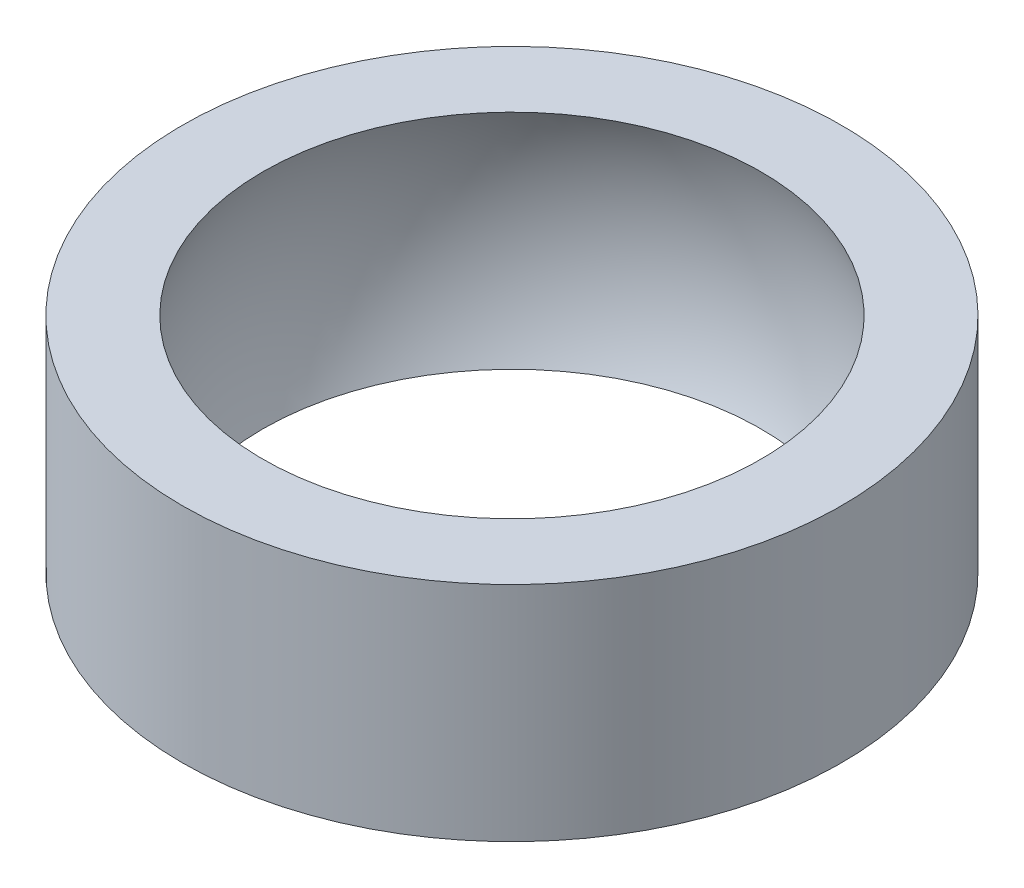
from build123d import *


with BuildPart() as part:
    # Esquisse1 → Base-R_volution (revolve)
    with BuildSketch(Plane.XY):
        with BuildLine():
            Line((-29.6, -10), (-22.366269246, -10))
            ThreePointArc((-22.366269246, -10), (-24.5, 0), (-22.366269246, 10))
            Line((-22.366269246, 10), (-29.6, 10))
            Line((-29.6, 10), (-29.6, -10))
        make_face()
    revolve(axis=Axis((0, 16.925053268, 0), (0, -1, 0)))


solid = part.part
